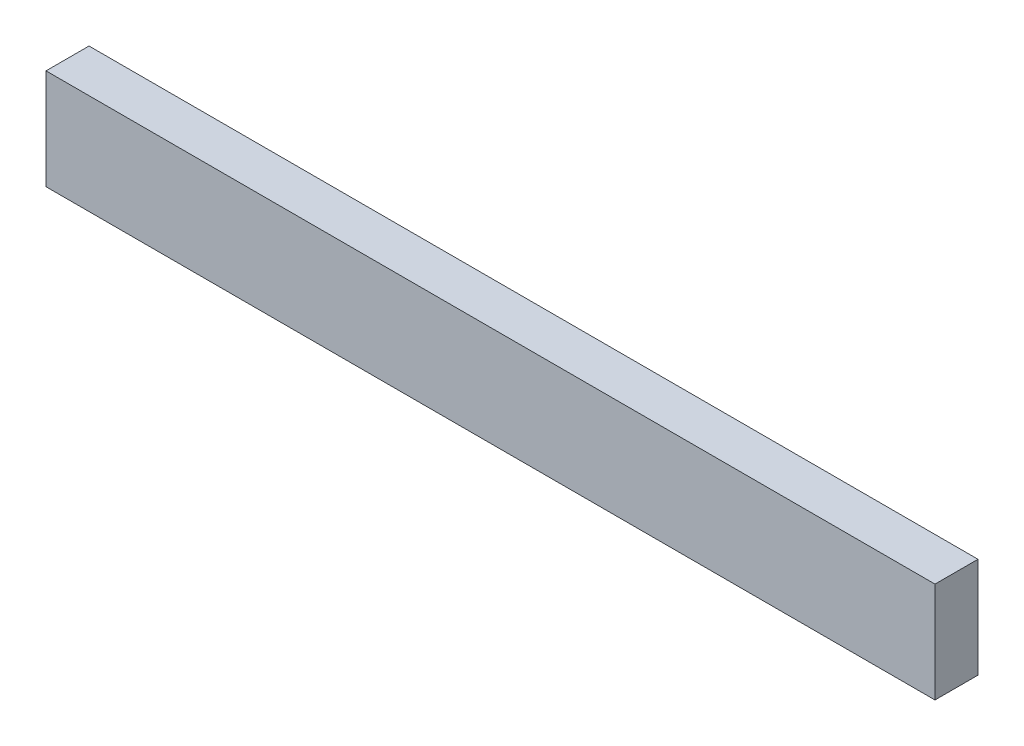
ISO-10303-21;
HEADER;
FILE_DESCRIPTION(('STEP AP214'),'2;1');
FILE_NAME('part.step','',(''),(''),'','','');
FILE_SCHEMA(('AUTOMOTIVE_DESIGN { 1 0 10303 214 1 1 1 1 }'));
ENDSEC;
DATA;
#1=APPLICATION_CONTEXT('core data for automotive mechanical design processes');
#2=APPLICATION_PROTOCOL_DEFINITION('international standard','automotive_design',2000,#1);
#3=PRODUCT_CONTEXT('',#1,'mechanical');
#4=PRODUCT('Part','Part','',(#3));
#5=PRODUCT_RELATED_PRODUCT_CATEGORY('part','',(#4));
#6=PRODUCT_DEFINITION_FORMATION('','',#4);
#7=PRODUCT_DEFINITION_CONTEXT('part definition',#1,'design');
#8=PRODUCT_DEFINITION('design','',#6,#7);
#9=PRODUCT_DEFINITION_SHAPE('','',#8);
#10=(LENGTH_UNIT() NAMED_UNIT(*) SI_UNIT(.MILLI.,.METRE.));
#11=(NAMED_UNIT(*) PLANE_ANGLE_UNIT() SI_UNIT($,.RADIAN.));
#12=(NAMED_UNIT(*) SI_UNIT($,.STERADIAN.) SOLID_ANGLE_UNIT());
#13=UNCERTAINTY_MEASURE_WITH_UNIT(LENGTH_MEASURE(1.E-05),#10,'distance_accuracy_value','');
#14=(GEOMETRIC_REPRESENTATION_CONTEXT(3) GLOBAL_UNCERTAINTY_ASSIGNED_CONTEXT((#13)) GLOBAL_UNIT_ASSIGNED_CONTEXT((#10,
#11,#12)) REPRESENTATION_CONTEXT('',''));
#15=CARTESIAN_POINT('',(0.,0.,0.));
#16=DIRECTION('',(0.,0.,1.));
#17=DIRECTION('',(1.,0.,0.));
#18=AXIS2_PLACEMENT_3D('',#15,#16,#17);
#19=CARTESIAN_POINT('',(787.4,-44.45,-19.05));
#20=DIRECTION('',(0.,0.,1.));
#21=DIRECTION('',(1.,0.,0.));
#22=AXIS2_PLACEMENT_3D('',#19,#20,#21);
#23=PLANE('',#22);
#24=DIRECTION('',(0.,1.,0.));
#25=VECTOR('',#24,1.);
#26=CARTESIAN_POINT('',(0.,-44.45,-19.05));
#27=LINE('',#26,#25);
#28=CARTESIAN_POINT('',(0.,-44.45,-19.05));
#29=VERTEX_POINT('',#28);
#30=CARTESIAN_POINT('',(0.,44.45,-19.05));
#31=VERTEX_POINT('',#30);
#32=EDGE_CURVE('E105',#29,#31,#27,.T.);
#33=ORIENTED_EDGE('',*,*,#32,.T.);
#34=DIRECTION('',(-1.,0.,0.));
#35=VECTOR('',#34,1.);
#36=CARTESIAN_POINT('',(787.4,44.45,-19.05));
#37=LINE('',#36,#35);
#38=CARTESIAN_POINT('',(787.4,44.45,-19.05));
#39=VERTEX_POINT('',#38);
#40=EDGE_CURVE('E11',#39,#31,#37,.T.);
#41=ORIENTED_EDGE('',*,*,#40,.F.);
#42=DIRECTION('',(0.,1.,0.));
#43=VECTOR('',#42,1.);
#44=CARTESIAN_POINT('',(787.4,-44.45,-19.05));
#45=LINE('',#44,#43);
#46=CARTESIAN_POINT('',(787.4,-44.45,-19.05));
#47=VERTEX_POINT('',#46);
#48=EDGE_CURVE('E88',#47,#39,#45,.T.);
#49=ORIENTED_EDGE('',*,*,#48,.F.);
#50=DIRECTION('',(-1.,0.,0.));
#51=VECTOR('',#50,1.);
#52=CARTESIAN_POINT('',(787.4,-44.45,-19.05));
#53=LINE('',#52,#51);
#54=EDGE_CURVE('E101',#47,#29,#53,.T.);
#55=ORIENTED_EDGE('',*,*,#54,.T.);
#56=EDGE_LOOP('',(#33,#41,#49,#55));
#57=FACE_BOUND('',#56,.T.);
#58=ADVANCED_FACE('F36',(#57),#23,.F.);
#59=CARTESIAN_POINT('',(787.4,44.45,19.05));
#60=DIRECTION('',(0.,-1.,0.));
#61=DIRECTION('',(0.,0.,-1.));
#62=AXIS2_PLACEMENT_3D('',#59,#60,#61);
#63=PLANE('',#62);
#64=DIRECTION('',(0.,0.,1.));
#65=VECTOR('',#64,1.);
#66=CARTESIAN_POINT('',(0.,44.45,19.05));
#67=LINE('',#66,#65);
#68=CARTESIAN_POINT('',(0.,44.45,19.05));
#69=VERTEX_POINT('',#68);
#70=EDGE_CURVE('E93',#31,#69,#67,.T.);
#71=ORIENTED_EDGE('',*,*,#70,.T.);
#72=DIRECTION('',(-1.,0.,0.));
#73=VECTOR('',#72,1.);
#74=CARTESIAN_POINT('',(787.4,44.45,19.05));
#75=LINE('',#74,#73);
#76=CARTESIAN_POINT('',(787.4,44.45,19.05));
#77=VERTEX_POINT('',#76);
#78=EDGE_CURVE('E45',#77,#69,#75,.T.);
#79=ORIENTED_EDGE('',*,*,#78,.F.);
#80=DIRECTION('',(0.,0.,1.));
#81=VECTOR('',#80,1.);
#82=CARTESIAN_POINT('',(787.4,44.45,19.05));
#83=LINE('',#82,#81);
#84=EDGE_CURVE('E83',#39,#77,#83,.T.);
#85=ORIENTED_EDGE('',*,*,#84,.F.);
#86=ORIENTED_EDGE('',*,*,#40,.T.);
#87=EDGE_LOOP('',(#71,#79,#85,#86));
#88=FACE_BOUND('',#87,.T.);
#89=ADVANCED_FACE('F92',(#88),#63,.F.);
#90=CARTESIAN_POINT('',(787.4,-44.45,19.05));
#91=DIRECTION('',(0.,0.,-1.));
#92=DIRECTION('',(-1.,0.,0.));
#93=AXIS2_PLACEMENT_3D('',#90,#91,#92);
#94=PLANE('',#93);
#95=DIRECTION('',(0.,-1.,0.));
#96=VECTOR('',#95,1.);
#97=CARTESIAN_POINT('',(0.,-44.45,19.05));
#98=LINE('',#97,#96);
#99=CARTESIAN_POINT('',(0.,-44.45,19.05));
#100=VERTEX_POINT('',#99);
#101=EDGE_CURVE('E70',#69,#100,#98,.T.);
#102=ORIENTED_EDGE('',*,*,#101,.T.);
#103=DIRECTION('',(-1.,0.,0.));
#104=VECTOR('',#103,1.);
#105=CARTESIAN_POINT('',(787.4,-44.45,19.05));
#106=LINE('',#105,#104);
#107=CARTESIAN_POINT('',(787.4,-44.45,19.05));
#108=VERTEX_POINT('',#107);
#109=EDGE_CURVE('E95',#108,#100,#106,.T.);
#110=ORIENTED_EDGE('',*,*,#109,.F.);
#111=DIRECTION('',(0.,-1.,0.));
#112=VECTOR('',#111,1.);
#113=CARTESIAN_POINT('',(787.4,-44.45,19.05));
#114=LINE('',#113,#112);
#115=EDGE_CURVE('E86',#77,#108,#114,.T.);
#116=ORIENTED_EDGE('',*,*,#115,.F.);
#117=ORIENTED_EDGE('',*,*,#78,.T.);
#118=EDGE_LOOP('',(#102,#110,#116,#117));
#119=FACE_BOUND('',#118,.T.);
#120=ADVANCED_FACE('F96',(#119),#94,.F.);
#121=CARTESIAN_POINT('',(787.4,-44.45,19.05));
#122=DIRECTION('',(0.,1.,0.));
#123=DIRECTION('',(0.,0.,1.));
#124=AXIS2_PLACEMENT_3D('',#121,#122,#123);
#125=PLANE('',#124);
#126=DIRECTION('',(0.,0.,-1.));
#127=VECTOR('',#126,1.);
#128=CARTESIAN_POINT('',(0.,-44.45,19.05));
#129=LINE('',#128,#127);
#130=EDGE_CURVE('E76',#100,#29,#129,.T.);
#131=ORIENTED_EDGE('',*,*,#130,.T.);
#132=ORIENTED_EDGE('',*,*,#54,.F.);
#133=DIRECTION('',(0.,0.,-1.));
#134=VECTOR('',#133,1.);
#135=CARTESIAN_POINT('',(787.4,-44.45,19.05));
#136=LINE('',#135,#134);
#137=EDGE_CURVE('E53',#108,#47,#136,.T.);
#138=ORIENTED_EDGE('',*,*,#137,.F.);
#139=ORIENTED_EDGE('',*,*,#109,.T.);
#140=EDGE_LOOP('',(#131,#132,#138,#139));
#141=FACE_BOUND('',#140,.T.);
#142=ADVANCED_FACE('F119',(#141),#125,.F.);
#143=CARTESIAN_POINT('',(787.4,0.,0.));
#144=DIRECTION('',(-1.,0.,0.));
#145=DIRECTION('',(0.,0.,1.));
#146=AXIS2_PLACEMENT_3D('',#143,#144,#145);
#147=PLANE('',#146);
#148=ORIENTED_EDGE('',*,*,#48,.T.);
#149=ORIENTED_EDGE('',*,*,#84,.T.);
#150=ORIENTED_EDGE('',*,*,#115,.T.);
#151=ORIENTED_EDGE('',*,*,#137,.T.);
#152=EDGE_LOOP('',(#148,#149,#150,#151));
#153=FACE_BOUND('',#152,.T.);
#154=ADVANCED_FACE('F84',(#153),#147,.F.);
#155=CARTESIAN_POINT('',(0.,0.,0.));
#156=DIRECTION('',(-1.,0.,0.));
#157=DIRECTION('',(0.,0.,1.));
#158=AXIS2_PLACEMENT_3D('',#155,#156,#157);
#159=PLANE('',#158);
#160=ORIENTED_EDGE('',*,*,#32,.F.);
#161=ORIENTED_EDGE('',*,*,#130,.F.);
#162=ORIENTED_EDGE('',*,*,#101,.F.);
#163=ORIENTED_EDGE('',*,*,#70,.F.);
#164=EDGE_LOOP('',(#160,#161,#162,#163));
#165=FACE_BOUND('',#164,.T.);
#166=ADVANCED_FACE('F122',(#165),#159,.T.);
#167=CLOSED_SHELL('',(#58,#89,#120,#142,#154,#166));
#168=MANIFOLD_SOLID_BREP('B2',#167);
#169=ADVANCED_BREP_SHAPE_REPRESENTATION('',(#18,#168),#14);
#170=SHAPE_DEFINITION_REPRESENTATION(#9,#169);
ENDSEC;
END-ISO-10303-21;
